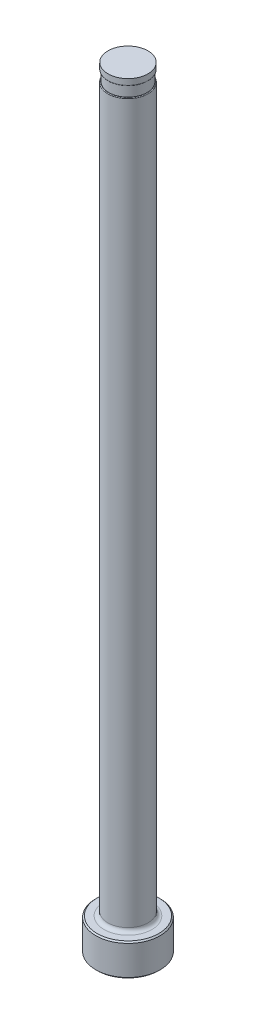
ISO-10303-21;
HEADER;
FILE_DESCRIPTION(('STEP AP214'),'2;1');
FILE_NAME('part.step','',(''),(''),'','','');
FILE_SCHEMA(('AUTOMOTIVE_DESIGN { 1 0 10303 214 1 1 1 1 }'));
ENDSEC;
DATA;
#1=APPLICATION_CONTEXT('core data for automotive mechanical design processes');
#2=APPLICATION_PROTOCOL_DEFINITION('international standard','automotive_design',2000,#1);
#3=PRODUCT_CONTEXT('',#1,'mechanical');
#4=PRODUCT('Part','Part','',(#3));
#5=PRODUCT_RELATED_PRODUCT_CATEGORY('part','',(#4));
#6=PRODUCT_DEFINITION_FORMATION('','',#4);
#7=PRODUCT_DEFINITION_CONTEXT('part definition',#1,'design');
#8=PRODUCT_DEFINITION('design','',#6,#7);
#9=PRODUCT_DEFINITION_SHAPE('','',#8);
#10=(LENGTH_UNIT() NAMED_UNIT(*) SI_UNIT(.MILLI.,.METRE.));
#11=(NAMED_UNIT(*) PLANE_ANGLE_UNIT() SI_UNIT($,.RADIAN.));
#12=(NAMED_UNIT(*) SI_UNIT($,.STERADIAN.) SOLID_ANGLE_UNIT());
#13=UNCERTAINTY_MEASURE_WITH_UNIT(LENGTH_MEASURE(1.E-05),#10,'distance_accuracy_value','');
#14=(GEOMETRIC_REPRESENTATION_CONTEXT(3) GLOBAL_UNCERTAINTY_ASSIGNED_CONTEXT((#13)) GLOBAL_UNIT_ASSIGNED_CONTEXT((#10,
#11,#12)) REPRESENTATION_CONTEXT('',''));
#15=CARTESIAN_POINT('',(0.,0.,0.));
#16=DIRECTION('',(0.,0.,1.));
#17=DIRECTION('',(1.,0.,0.));
#18=AXIS2_PLACEMENT_3D('',#15,#16,#17);
#19=CARTESIAN_POINT('',(-3.96874999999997,151.13,0.));
#20=DIRECTION('',(0.,1.,0.));
#21=DIRECTION('',(0.,0.,1.));
#22=AXIS2_PLACEMENT_3D('',#19,#20,#21);
#23=PLANE('',#22);
#24=CARTESIAN_POINT('',(0.,151.13,0.));
#25=DIRECTION('',(0.,1.,0.));
#26=DIRECTION('',(0.,0.,1.));
#27=AXIS2_PLACEMENT_3D('',#24,#25,#26);
#28=CIRCLE('',#27,3.82269999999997);
#29=CARTESIAN_POINT('',(0.,151.13,3.82269999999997));
#30=VERTEX_POINT('',#29);
#31=EDGE_CURVE('E11',#30,#30,#28,.F.);
#32=ORIENTED_EDGE('',*,*,#31,.T.);
#33=EDGE_LOOP('',(#32));
#34=FACE_BOUND('',#33,.T.);
#35=CARTESIAN_POINT('',(0.,151.13,0.));
#36=DIRECTION('',(0.,1.,0.));
#37=DIRECTION('',(0.,0.,1.));
#38=AXIS2_PLACEMENT_3D('',#35,#36,#37);
#39=CIRCLE('',#38,3.76554999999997);
#40=CARTESIAN_POINT('',(0.,151.13,3.76554999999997));
#41=VERTEX_POINT('',#40);
#42=EDGE_CURVE('E78',#41,#41,#39,.T.);
#43=ORIENTED_EDGE('',*,*,#42,.T.);
#44=EDGE_LOOP('',(#43));
#45=FACE_BOUND('',#44,.T.);
#46=ADVANCED_FACE('F36',(#34,#45),#23,.F.);
#47=CARTESIAN_POINT('',(0.,259.958771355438,0.));
#48=DIRECTION('',(0.,1.,0.));
#49=DIRECTION('',(0.,0.,1.));
#50=AXIS2_PLACEMENT_3D('',#47,#48,#49);
#51=CYLINDRICAL_SURFACE('',#50,3.96874999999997);
#52=DIRECTION('',(0.,1.,0.));
#53=VECTOR('',#52,1.);
#54=CARTESIAN_POINT('',(-3.76554999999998,259.958771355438,-1.25363860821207));
#55=LINE('',#54,#53);
#56=CARTESIAN_POINT('',(-3.76554999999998,148.971,-1.25363860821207));
#57=VERTEX_POINT('',#56);
#58=CARTESIAN_POINT('',(-3.76554999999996,86.614,-1.25363860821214));
#59=VERTEX_POINT('',#58);
#60=EDGE_CURVE('E73',#57,#59,#55,.F.);
#61=ORIENTED_EDGE('',*,*,#60,.F.);
#62=CARTESIAN_POINT('',(0.,148.971,0.));
#63=DIRECTION('',(0.,-1.,0.));
#64=DIRECTION('',(0.,0.,-1.));
#65=AXIS2_PLACEMENT_3D('',#62,#63,#64);
#66=CIRCLE('',#65,3.96874999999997);
#67=CARTESIAN_POINT('',(-3.76554999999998,148.971,1.25363860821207));
#68=VERTEX_POINT('',#67);
#69=EDGE_CURVE('E51',#57,#68,#66,.T.);
#70=ORIENTED_EDGE('',*,*,#69,.T.);
#71=DIRECTION('',(0.,1.,0.));
#72=VECTOR('',#71,1.);
#73=CARTESIAN_POINT('',(-3.76554999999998,259.958771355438,1.25363860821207));
#74=LINE('',#73,#72);
#75=CARTESIAN_POINT('',(-3.76554999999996,86.614,1.25363860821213));
#76=VERTEX_POINT('',#75);
#77=EDGE_CURVE('E84',#76,#68,#74,.T.);
#78=ORIENTED_EDGE('',*,*,#77,.F.);
#79=CARTESIAN_POINT('',(-3.76554999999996,86.614,-1.25363860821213));
#80=CARTESIAN_POINT('',(-3.76554761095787,86.5842664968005,-1.25363893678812));
#81=CARTESIAN_POINT('',(-3.76596820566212,86.5545487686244,-1.25238314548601));
#82=CARTESIAN_POINT('',(-3.76762981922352,86.4953538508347,-1.24737825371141));
#83=CARTESIAN_POINT('',(-3.76887065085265,86.4658766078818,-1.24362972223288));
#84=CARTESIAN_POINT('',(-3.77377172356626,86.3783445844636,-1.22871446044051));
#85=CARTESIAN_POINT('',(-3.7786109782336,86.3209361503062,-1.21387766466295));
#86=CARTESIAN_POINT('',(-3.79089599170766,86.2097164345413,-1.17494432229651));
#87=CARTESIAN_POINT('',(-3.79834108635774,86.1559042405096,-1.15085013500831));
#88=CARTESIAN_POINT('',(-3.81503450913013,86.0532087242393,-1.09423745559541));
#89=CARTESIAN_POINT('',(-3.82428345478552,86.0043270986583,-1.06171607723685));
#90=CARTESIAN_POINT('',(-3.84371902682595,85.912215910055,-0.989050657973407));
#91=CARTESIAN_POINT('',(-3.85391232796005,85.8690327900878,-0.94884982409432));
#92=CARTESIAN_POINT('',(-3.87421414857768,85.789439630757,-0.862218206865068));
#93=CARTESIAN_POINT('',(-3.88432263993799,85.7530317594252,-0.815785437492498));
#94=CARTESIAN_POINT('',(-3.90447970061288,85.6843203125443,-0.713424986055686));
#95=CARTESIAN_POINT('',(-3.91443636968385,85.6527071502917,-0.657016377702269));
#96=CARTESIAN_POINT('',(-3.93230837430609,85.5981594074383,-0.539855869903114));
#97=CARTESIAN_POINT('',(-3.94022284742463,85.5752284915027,-0.479102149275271));
#98=CARTESIAN_POINT('',(-3.95405226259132,85.5360681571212,-0.348163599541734));
#99=CARTESIAN_POINT('',(-3.95966879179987,85.520798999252,-0.277659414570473));
#100=CARTESIAN_POINT('',(-3.96709876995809,85.5007501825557,-0.134969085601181));
#101=CARTESIAN_POINT('',(-3.96891039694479,85.4959755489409,-0.0627821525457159));
#102=CARTESIAN_POINT('',(-3.96855474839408,85.4969169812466,0.0868803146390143));
#103=CARTESIAN_POINT('',(-3.96608295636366,85.5034359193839,0.16435170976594));
#104=CARTESIAN_POINT('',(-3.95680487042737,85.5286115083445,0.317057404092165));
#105=CARTESIAN_POINT('',(-3.94999780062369,85.5472703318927,0.392291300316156));
#106=CARTESIAN_POINT('',(-3.93277618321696,85.5968426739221,0.538182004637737));
#107=CARTESIAN_POINT('',(-3.92236273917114,85.6277524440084,0.608840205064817));
#108=CARTESIAN_POINT('',(-3.8991687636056,85.7017930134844,0.743029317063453));
#109=CARTESIAN_POINT('',(-3.88638957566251,85.7449168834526,0.806564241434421));
#110=CARTESIAN_POINT('',(-3.86127801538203,85.838843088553,0.919000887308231));
#111=CARTESIAN_POINT('',(-3.84899411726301,85.8887331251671,0.968673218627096));
#112=CARTESIAN_POINT('',(-3.82552074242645,85.9973276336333,1.05758636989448));
#113=CARTESIAN_POINT('',(-3.81433058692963,86.0560265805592,1.09683368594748));
#114=CARTESIAN_POINT('',(-3.79578266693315,86.1733369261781,1.15929047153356));
#115=CARTESIAN_POINT('',(-3.78813455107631,86.2312068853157,1.18381204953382));
#116=CARTESIAN_POINT('',(-3.77592606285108,86.350640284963,1.2221998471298));
#117=CARTESIAN_POINT('',(-3.77135975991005,86.4121963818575,1.23608653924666));
#118=CARTESIAN_POINT('',(-3.76759831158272,86.4976117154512,1.24747178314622));
#119=CARTESIAN_POINT('',(-3.76683119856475,86.520841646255,1.24978469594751));
#120=CARTESIAN_POINT('',(-3.76580747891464,86.5673769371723,1.25286606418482));
#121=CARTESIAN_POINT('',(-3.76555004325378,86.5906821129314,1.25363702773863));
#122=CARTESIAN_POINT('',(-3.76554999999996,86.614,1.25363860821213));
#123=B_SPLINE_CURVE_WITH_KNOTS('',3,(#79,#80,#81,#82,#83,#84,#85,#86,#87,#88,#89,#90,#91,#92,
#93,#94,#95,#96,#97,#98,#99,#100,#101,#102,#103,#104,#105,#106,#107,#108,#109,#110,#111,#112,
#113,#114,#115,#116,#117,#118,#119,#120,#121,#122),.UNSPECIFIED.,.F.,.F.,(4,2,2,2,2,2,2,2,2,2,2,
2,2,2,2,2,2,2,2,2,2,4),(0.,0.0891400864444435,0.178259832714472,0.355749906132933,
0.533194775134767,0.710700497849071,0.88957367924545,1.06850400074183,1.26397301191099,
1.45952443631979,1.67567306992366,1.89192518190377,2.12418795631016,2.35649231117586,
2.58872564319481,2.82082748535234,3.03401201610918,3.24706339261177,3.43601078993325,
3.62459353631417,3.6946217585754,3.76453598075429),.UNSPECIFIED.);
#124=EDGE_CURVE('E81',#59,#76,#123,.T.);
#125=ORIENTED_EDGE('',*,*,#124,.F.);
#126=EDGE_LOOP('',(#61,#70,#78,#125));
#127=FACE_BOUND('',#126,.T.);
#128=CARTESIAN_POINT('',(0.,7.11200000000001,0.));
#129=DIRECTION('',(0.,1.,0.));
#130=DIRECTION('',(0.,0.,1.));
#131=AXIS2_PLACEMENT_3D('',#128,#129,#130);
#132=CIRCLE('',#131,3.96874999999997);
#133=CARTESIAN_POINT('',(0.,7.11200000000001,3.96874999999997));
#134=VERTEX_POINT('',#133);
#135=EDGE_CURVE('E116',#134,#134,#132,.T.);
#136=ORIENTED_EDGE('',*,*,#135,.T.);
#137=EDGE_LOOP('',(#136));
#138=FACE_BOUND('',#137,.T.);
#139=ADVANCED_FACE('F82',(#127,#138),#51,.T.);
#140=CARTESIAN_POINT('',(0.,0.,0.));
#141=DIRECTION('',(0.,-1.,0.));
#142=DIRECTION('',(0.,0.,-1.));
#143=AXIS2_PLACEMENT_3D('',#140,#141,#142);
#144=PLANE('',#143);
#145=CARTESIAN_POINT('',(0.,0.,0.));
#146=DIRECTION('',(0.,-1.,0.));
#147=DIRECTION('',(0.,0.,-1.));
#148=AXIS2_PLACEMENT_3D('',#145,#146,#147);
#149=CIRCLE('',#148,6.09599999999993);
#150=CARTESIAN_POINT('',(0.,0.,-6.09599999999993));
#151=VERTEX_POINT('',#150);
#152=EDGE_CURVE('E113',#151,#151,#149,.T.);
#153=ORIENTED_EDGE('',*,*,#152,.T.);
#154=EDGE_LOOP('',(#153));
#155=FACE_BOUND('',#154,.T.);
#156=ADVANCED_FACE('F192',(#155),#144,.T.);
#157=CARTESIAN_POINT('',(0.,259.958771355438,0.));
#158=DIRECTION('',(0.,1.,0.));
#159=DIRECTION('',(0.,0.,1.));
#160=AXIS2_PLACEMENT_3D('',#157,#158,#159);
#161=CYLINDRICAL_SURFACE('',#160,6.34999999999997);
#162=CARTESIAN_POINT('',(0.,6.09599999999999,0.));
#163=DIRECTION('',(0.,1.,0.));
#164=DIRECTION('',(0.,0.,1.));
#165=AXIS2_PLACEMENT_3D('',#162,#163,#164);
#166=CIRCLE('',#165,6.34999999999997);
#167=CARTESIAN_POINT('',(0.,6.09599999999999,6.34999999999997));
#168=VERTEX_POINT('',#167);
#169=EDGE_CURVE('E110',#168,#168,#166,.F.);
#170=ORIENTED_EDGE('',*,*,#169,.T.);
#171=EDGE_LOOP('',(#170));
#172=FACE_BOUND('',#171,.T.);
#173=CARTESIAN_POINT('',(0.,0.254000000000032,0.));
#174=DIRECTION('',(0.,-1.,0.));
#175=DIRECTION('',(0.,0.,-1.));
#176=AXIS2_PLACEMENT_3D('',#173,#174,#175);
#177=CIRCLE('',#176,6.34999999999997);
#178=CARTESIAN_POINT('',(0.,0.254000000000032,-6.34999999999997));
#179=VERTEX_POINT('',#178);
#180=EDGE_CURVE('E107',#179,#179,#177,.F.);
#181=ORIENTED_EDGE('',*,*,#180,.T.);
#182=EDGE_LOOP('',(#181));
#183=FACE_BOUND('',#182,.T.);
#184=ADVANCED_FACE('F195',(#172,#183),#161,.T.);
#185=CARTESIAN_POINT('',(-6.34999999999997,6.35,0.));
#186=DIRECTION('',(0.,1.,0.));
#187=DIRECTION('',(0.,0.,1.));
#188=AXIS2_PLACEMENT_3D('',#185,#186,#187);
#189=PLANE('',#188);
#190=CARTESIAN_POINT('',(0.,6.35,0.));
#191=DIRECTION('',(0.,1.,0.));
#192=DIRECTION('',(0.,0.,1.));
#193=AXIS2_PLACEMENT_3D('',#190,#191,#192);
#194=CIRCLE('',#193,4.73074999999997);
#195=CARTESIAN_POINT('',(0.,6.35,4.73074999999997));
#196=VERTEX_POINT('',#195);
#197=EDGE_CURVE('E87',#196,#196,#194,.F.);
#198=ORIENTED_EDGE('',*,*,#197,.T.);
#199=EDGE_LOOP('',(#198));
#200=FACE_BOUND('',#199,.T.);
#201=CARTESIAN_POINT('',(0.,6.35,0.));
#202=DIRECTION('',(0.,1.,0.));
#203=DIRECTION('',(0.,0.,1.));
#204=AXIS2_PLACEMENT_3D('',#201,#202,#203);
#205=CIRCLE('',#204,6.096);
#206=CARTESIAN_POINT('',(0.,6.35,6.096));
#207=VERTEX_POINT('',#206);
#208=EDGE_CURVE('E104',#207,#207,#205,.T.);
#209=ORIENTED_EDGE('',*,*,#208,.T.);
#210=EDGE_LOOP('',(#209));
#211=FACE_BOUND('',#210,.T.);
#212=ADVANCED_FACE('F190',(#200,#211),#189,.T.);
#213=CARTESIAN_POINT('',(0.,6.35000000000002,0.));
#214=DIRECTION('',(0.,-1.,0.));
#215=DIRECTION('',(0.,0.,-1.));
#216=AXIS2_PLACEMENT_3D('',#213,#214,#215);
#217=CONICAL_SURFACE('',#216,6.09599999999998,0.78539816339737);
#218=ORIENTED_EDGE('',*,*,#169,.F.);
#219=EDGE_LOOP('',(#218));
#220=FACE_BOUND('',#219,.T.);
#221=ORIENTED_EDGE('',*,*,#208,.F.);
#222=EDGE_LOOP('',(#221));
#223=FACE_BOUND('',#222,.T.);
#224=ADVANCED_FACE('F186',(#220,#223),#217,.T.);
#225=CARTESIAN_POINT('',(0.,0.254000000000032,0.));
#226=DIRECTION('',(0.,1.,0.));
#227=DIRECTION('',(0.,0.,1.));
#228=AXIS2_PLACEMENT_3D('',#225,#226,#227);
#229=CONICAL_SURFACE('',#228,6.34999999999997,0.785398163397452);
#230=ORIENTED_EDGE('',*,*,#152,.F.);
#231=EDGE_LOOP('',(#230));
#232=FACE_BOUND('',#231,.T.);
#233=ORIENTED_EDGE('',*,*,#180,.F.);
#234=EDGE_LOOP('',(#233));
#235=FACE_BOUND('',#234,.T.);
#236=ADVANCED_FACE('F182',(#232,#235),#229,.T.);
#237=CARTESIAN_POINT('',(0.,7.11200000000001,0.));
#238=DIRECTION('',(0.,1.,0.));
#239=DIRECTION('',(0.,0.,1.));
#240=AXIS2_PLACEMENT_3D('',#237,#238,#239);
#241=TOROIDAL_SURFACE('',#240,4.73074999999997,0.762);
#242=ORIENTED_EDGE('',*,*,#197,.F.);
#243=EDGE_LOOP('',(#242));
#244=FACE_BOUND('',#243,.T.);
#245=ORIENTED_EDGE('',*,*,#135,.F.);
#246=EDGE_LOOP('',(#245));
#247=FACE_BOUND('',#246,.T.);
#248=ADVANCED_FACE('F147',(#244,#247),#241,.F.);
#249=CARTESIAN_POINT('',(-3.96874999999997,149.098,0.));
#250=DIRECTION('',(0.,-1.,0.));
#251=DIRECTION('',(0.,0.,-1.));
#252=AXIS2_PLACEMENT_3D('',#249,#250,#251);
#253=PLANE('',#252);
#254=DIRECTION('',(0.,0.,1.));
#255=VECTOR('',#254,1.);
#256=CARTESIAN_POINT('',(-3.76554999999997,149.098,0.));
#257=LINE('',#256,#255);
#258=CARTESIAN_POINT('',(-3.76554999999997,149.098,0.));
#259=VERTEX_POINT('',#258);
#260=CARTESIAN_POINT('',(-3.76554999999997,149.098,0.761364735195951));
#261=VERTEX_POINT('',#260);
#262=EDGE_CURVE('E90',#259,#261,#257,.T.);
#263=ORIENTED_EDGE('',*,*,#262,.T.);
#264=CARTESIAN_POINT('',(0.,149.098,0.));
#265=DIRECTION('',(0.,-1.,0.));
#266=DIRECTION('',(0.,0.,-1.));
#267=AXIS2_PLACEMENT_3D('',#264,#265,#266);
#268=CIRCLE('',#267,3.84174999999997);
#269=CARTESIAN_POINT('',(-3.76554999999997,149.098,-0.761364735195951));
#270=VERTEX_POINT('',#269);
#271=EDGE_CURVE('E86',#261,#270,#268,.F.);
#272=ORIENTED_EDGE('',*,*,#271,.T.);
#273=EDGE_CURVE('E79',#270,#259,#257,.T.);
#274=ORIENTED_EDGE('',*,*,#273,.T.);
#275=CARTESIAN_POINT('',(0.,149.098,0.));
#276=DIRECTION('',(0.,1.,0.));
#277=DIRECTION('',(0.,0.,1.));
#278=AXIS2_PLACEMENT_3D('',#275,#276,#277);
#279=CIRCLE('',#278,3.76554999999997);
#280=EDGE_CURVE('E101',#259,#259,#279,.T.);
#281=ORIENTED_EDGE('',*,*,#280,.F.);
#282=EDGE_LOOP('',(#263,#272,#274,#281));
#283=FACE_BOUND('',#282,.T.);
#284=ADVANCED_FACE('F144',(#283),#253,.F.);
#285=CARTESIAN_POINT('',(0.,153.448281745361,0.));
#286=DIRECTION('',(0.,1.,0.));
#287=DIRECTION('',(0.,0.,1.));
#288=AXIS2_PLACEMENT_3D('',#285,#286,#287);
#289=CYLINDRICAL_SURFACE('',#288,3.76554999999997);
#290=ORIENTED_EDGE('',*,*,#42,.F.);
#291=EDGE_LOOP('',(#290));
#292=FACE_BOUND('',#291,.T.);
#293=ORIENTED_EDGE('',*,*,#280,.T.);
#294=EDGE_LOOP('',(#293));
#295=FACE_BOUND('',#294,.T.);
#296=ADVANCED_FACE('F141',(#292,#295),#289,.T.);
#297=CARTESIAN_POINT('',(-3.76554999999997,150.114,-6.34999999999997));
#298=DIRECTION('',(1.,0.,0.));
#299=DIRECTION('',(0.,1.,0.));
#300=AXIS2_PLACEMENT_3D('',#297,#298,#299);
#301=PLANE('',#300);
#302=ORIENTED_EDGE('',*,*,#273,.F.);
#303=CARTESIAN_POINT('',(-3.76554999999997,149.098,-0.761364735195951));
#304=CARTESIAN_POINT('',(-3.76554999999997,149.097994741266,-0.782493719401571));
#305=CARTESIAN_POINT('',(-3.76554999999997,149.097792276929,-0.803626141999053));
#306=CARTESIAN_POINT('',(-3.76554999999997,149.096859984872,-0.845902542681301));
#307=CARTESIAN_POINT('',(-3.76554999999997,149.096129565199,-0.867046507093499));
#308=CARTESIAN_POINT('',(-3.76554999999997,149.094000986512,-0.909439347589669));
#309=CARTESIAN_POINT('',(-3.76554999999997,149.092598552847,-0.930688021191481));
#310=CARTESIAN_POINT('',(-3.76554999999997,149.088932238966,-0.97310444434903));
#311=CARTESIAN_POINT('',(-3.76554999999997,149.086668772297,-0.994272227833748));
#312=CARTESIAN_POINT('',(-3.76554999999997,149.081963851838,-1.02925031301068));
#313=CARTESIAN_POINT('',(-3.76554999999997,149.079847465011,-1.04310326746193));
#314=CARTESIAN_POINT('',(-3.76554999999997,149.074992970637,-1.07067599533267));
#315=CARTESIAN_POINT('',(-3.76554999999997,149.072255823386,-1.08439594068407));
#316=CARTESIAN_POINT('',(-3.76554999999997,149.064714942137,-1.117227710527));
#317=CARTESIAN_POINT('',(-3.76554999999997,149.059523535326,-1.13626053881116));
#318=CARTESIAN_POINT('',(-3.76554999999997,149.049554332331,-1.1650285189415));
#319=CARTESIAN_POINT('',(-3.76554999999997,149.045656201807,-1.17506664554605));
#320=CARTESIAN_POINT('',(-3.76554999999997,149.036804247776,-1.19465815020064));
#321=CARTESIAN_POINT('',(-3.76554999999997,149.031854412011,-1.2042131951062));
#322=CARTESIAN_POINT('',(-3.76554999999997,149.023843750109,-1.21677899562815));
#323=CARTESIAN_POINT('',(-3.76554999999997,149.021472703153,-1.22022603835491));
#324=CARTESIAN_POINT('',(-3.76554999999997,149.016417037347,-1.22689753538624));
#325=CARTESIAN_POINT('',(-3.76554999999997,149.013731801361,-1.23012153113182));
#326=CARTESIAN_POINT('',(-3.76554999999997,149.007951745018,-1.23626135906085));
#327=CARTESIAN_POINT('',(-3.76554999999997,149.004852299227,-1.23917292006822));
#328=CARTESIAN_POINT('',(-3.76554999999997,148.998201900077,-1.24442799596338));
#329=CARTESIAN_POINT('',(-3.76554999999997,148.994652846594,-1.24677378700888));
#330=CARTESIAN_POINT('',(-3.76554999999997,148.988648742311,-1.2497967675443));
#331=CARTESIAN_POINT('',(-3.76554999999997,148.986340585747,-1.25076391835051));
#332=CARTESIAN_POINT('',(-3.76554999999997,148.981598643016,-1.25230606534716));
#333=CARTESIAN_POINT('',(-3.76554999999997,148.979165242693,-1.2528821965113));
#334=CARTESIAN_POINT('',(-3.76554999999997,148.975758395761,-1.25336754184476));
#335=CARTESIAN_POINT('',(-3.76554999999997,148.974810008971,-1.2534689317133));
#336=CARTESIAN_POINT('',(-3.76554999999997,148.972907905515,-1.25360450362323));
#337=CARTESIAN_POINT('',(-3.76554999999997,148.971954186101,-1.25363864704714));
#338=CARTESIAN_POINT('',(-3.76554999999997,148.971,-1.25363860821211));
#339=B_SPLINE_CURVE_WITH_KNOTS('',3,(#303,#304,#305,#306,#307,#308,#309,#310,#311,#312,#313,
#314,#315,#316,#317,#318,#319,#320,#321,#322,#323,#324,#325,#326,#327,#328,#329,#330,#331,#332,
#333,#334,#335,#336,#337,#338),.UNSPECIFIED.,.F.,.F.,(4,2,2,2,2,2,2,2,2,2,2,2,2,2,2,2,2,4),(0.,
0.0633913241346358,0.126853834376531,0.19072549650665,0.254566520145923,0.29659421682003,
0.338557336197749,0.397605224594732,0.429880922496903,0.462036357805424,0.474575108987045,
0.487138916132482,0.499857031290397,0.512523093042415,0.520004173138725,0.527463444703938,
0.530322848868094,0.533183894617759),.UNSPECIFIED.);
#340=EDGE_CURVE('E59',#270,#57,#339,.T.);
#341=ORIENTED_EDGE('',*,*,#340,.T.);
#342=ORIENTED_EDGE('',*,*,#60,.T.);
#343=DIRECTION('',(0.,0.,1.));
#344=VECTOR('',#343,1.);
#345=CARTESIAN_POINT('',(-3.76554999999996,86.614,-6.34999999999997));
#346=LINE('',#345,#344);
#347=EDGE_CURVE('E77',#59,#76,#346,.T.);
#348=ORIENTED_EDGE('',*,*,#347,.T.);
#349=ORIENTED_EDGE('',*,*,#77,.T.);
#350=CARTESIAN_POINT('',(-3.76554999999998,148.971,1.25363860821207));
#351=CARTESIAN_POINT('',(-3.76554999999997,148.973613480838,1.25364684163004));
#352=CARTESIAN_POINT('',(-3.76554999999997,148.976215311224,1.25338363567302));
#353=CARTESIAN_POINT('',(-3.76554999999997,148.981293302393,1.25239294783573));
#354=CARTESIAN_POINT('',(-3.76554999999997,148.983770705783,1.25167195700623));
#355=CARTESIAN_POINT('',(-3.76554999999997,148.989154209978,1.24961912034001));
#356=CARTESIAN_POINT('',(-3.76554999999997,148.992019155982,1.24818173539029));
#357=CARTESIAN_POINT('',(-3.76554999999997,148.997493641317,1.24486563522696));
#358=CARTESIAN_POINT('',(-3.76554999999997,149.00010160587,1.24298441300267));
#359=CARTESIAN_POINT('',(-3.76554999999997,149.006800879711,1.23749178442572));
#360=CARTESIAN_POINT('',(-3.76554999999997,149.010652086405,1.23359127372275));
#361=CARTESIAN_POINT('',(-3.76554999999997,149.017763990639,1.22529610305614));
#362=CARTESIAN_POINT('',(-3.76554999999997,149.021023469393,1.22090045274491));
#363=CARTESIAN_POINT('',(-3.76554999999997,149.032610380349,1.203601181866));
#364=CARTESIAN_POINT('',(-3.76554999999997,149.039424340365,1.18970762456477));
#365=CARTESIAN_POINT('',(-3.76554999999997,149.051184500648,1.16115732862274));
#366=CARTESIAN_POINT('',(-3.76554999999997,149.056117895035,1.1464961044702));
#367=CARTESIAN_POINT('',(-3.76554999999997,149.067974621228,1.10570448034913));
#368=CARTESIAN_POINT('',(-3.76554999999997,149.073623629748,1.07920308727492));
#369=CARTESIAN_POINT('',(-3.76554999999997,149.08273714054,1.02581528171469));
#370=CARTESIAN_POINT('',(-3.76554999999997,149.086195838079,0.998928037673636));
#371=CARTESIAN_POINT('',(-3.76554999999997,149.091595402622,0.944998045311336));
#372=CARTESIAN_POINT('',(-3.76554999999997,149.093536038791,0.9179552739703));
#373=CARTESIAN_POINT('',(-3.76554999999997,149.096323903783,0.863847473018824));
#374=CARTESIAN_POINT('',(-3.76554999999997,149.097172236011,0.836782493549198));
#375=CARTESIAN_POINT('',(-3.76554999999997,149.097747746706,0.801647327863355));
#376=CARTESIAN_POINT('',(-3.76554999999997,149.09784390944,0.793581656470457));
#377=CARTESIAN_POINT('',(-3.76554999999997,149.097969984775,0.777465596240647));
#378=CARTESIAN_POINT('',(-3.76554999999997,149.098000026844,0.769415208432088));
#379=CARTESIAN_POINT('',(-3.76554999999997,149.098,0.761364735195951));
#380=B_SPLINE_CURVE_WITH_KNOTS('',3,(#350,#351,#352,#353,#354,#355,#356,#357,#358,#359,#360,
#361,#362,#363,#364,#365,#366,#367,#368,#369,#370,#371,#372,#373,#374,#375,#376,#377,#378,#379),
.UNSPECIFIED.,.F.,.F.,(4,2,2,2,2,2,2,2,2,2,2,2,2,2,4),(0.,0.00780850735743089,0.01550869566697,
0.0250704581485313,0.0346875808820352,0.0510390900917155,0.0674239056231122,0.113484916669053,
0.159854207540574,0.240929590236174,0.322218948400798,0.403520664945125,0.484740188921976,
0.508938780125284,0.533089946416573),.UNSPECIFIED.);
#381=EDGE_CURVE('E172',#68,#261,#380,.T.);
#382=ORIENTED_EDGE('',*,*,#381,.T.);
#383=ORIENTED_EDGE('',*,*,#262,.F.);
#384=EDGE_LOOP('',(#302,#341,#342,#348,#349,#382,#383));
#385=FACE_BOUND('',#384,.T.);
#386=ADVANCED_FACE('F75',(#385),#301,.F.);
#387=CARTESIAN_POINT('',(-6.94054999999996,86.614,-6.34999999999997));
#388=DIRECTION('',(0.,0.,1.));
#389=DIRECTION('',(1.,0.,0.));
#390=AXIS2_PLACEMENT_3D('',#387,#388,#389);
#391=CYLINDRICAL_SURFACE('',#390,3.175);
#392=ORIENTED_EDGE('',*,*,#347,.F.);
#393=ORIENTED_EDGE('',*,*,#124,.T.);
#394=EDGE_LOOP('',(#392,#393));
#395=FACE_BOUND('',#394,.T.);
#396=ADVANCED_FACE('F89',(#395),#391,.F.);
#397=CARTESIAN_POINT('',(0.,152.687735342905,0.));
#398=DIRECTION('',(0.,1.,0.));
#399=DIRECTION('',(0.,0.,1.));
#400=AXIS2_PLACEMENT_3D('',#397,#398,#399);
#401=CYLINDRICAL_SURFACE('',#400,3.94969999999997);
#402=CARTESIAN_POINT('',(0.,151.257,0.));
#403=DIRECTION('',(0.,1.,0.));
#404=DIRECTION('',(0.,0.,1.));
#405=AXIS2_PLACEMENT_3D('',#402,#403,#404);
#406=CIRCLE('',#405,3.94969999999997);
#407=CARTESIAN_POINT('',(0.,151.257,3.94969999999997));
#408=VERTEX_POINT('',#407);
#409=EDGE_CURVE('E44',#408,#408,#406,.T.);
#410=ORIENTED_EDGE('',*,*,#409,.T.);
#411=EDGE_LOOP('',(#410));
#412=FACE_BOUND('',#411,.T.);
#413=CARTESIAN_POINT('',(0.,152.4,0.));
#414=DIRECTION('',(0.,1.,0.));
#415=DIRECTION('',(0.,0.,1.));
#416=AXIS2_PLACEMENT_3D('',#413,#414,#415);
#417=CIRCLE('',#416,3.94969999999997);
#418=CARTESIAN_POINT('',(0.,152.4,3.94969999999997));
#419=VERTEX_POINT('',#418);
#420=EDGE_CURVE('E91',#419,#419,#417,.T.);
#421=ORIENTED_EDGE('',*,*,#420,.F.);
#422=EDGE_LOOP('',(#421));
#423=FACE_BOUND('',#422,.T.);
#424=ADVANCED_FACE('F135',(#412,#423),#401,.T.);
#425=CARTESIAN_POINT('',(-3.96874999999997,152.4,0.));
#426=DIRECTION('',(0.,1.,0.));
#427=DIRECTION('',(0.,0.,1.));
#428=AXIS2_PLACEMENT_3D('',#425,#426,#427);
#429=PLANE('',#428);
#430=ORIENTED_EDGE('',*,*,#420,.T.);
#431=EDGE_LOOP('',(#430));
#432=FACE_BOUND('',#431,.T.);
#433=ADVANCED_FACE('F149',(#432),#429,.T.);
#434=CARTESIAN_POINT('',(0.,148.971,0.));
#435=DIRECTION('',(0.,-1.,0.));
#436=DIRECTION('',(0.,0.,-1.));
#437=AXIS2_PLACEMENT_3D('',#434,#435,#436);
#438=TOROIDAL_SURFACE('',#437,3.84174999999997,0.127);
#439=ORIENTED_EDGE('',*,*,#381,.F.);
#440=ORIENTED_EDGE('',*,*,#69,.F.);
#441=ORIENTED_EDGE('',*,*,#340,.F.);
#442=ORIENTED_EDGE('',*,*,#271,.F.);
#443=EDGE_LOOP('',(#439,#440,#441,#442));
#444=FACE_BOUND('',#443,.T.);
#445=ADVANCED_FACE('F151',(#444),#438,.T.);
#446=CARTESIAN_POINT('',(0.,151.257,0.));
#447=DIRECTION('',(0.,1.,0.));
#448=DIRECTION('',(0.,0.,1.));
#449=AXIS2_PLACEMENT_3D('',#446,#447,#448);
#450=TOROIDAL_SURFACE('',#449,3.82269999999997,0.127);
#451=ORIENTED_EDGE('',*,*,#31,.F.);
#452=EDGE_LOOP('',(#451));
#453=FACE_BOUND('',#452,.T.);
#454=ORIENTED_EDGE('',*,*,#409,.F.);
#455=EDGE_LOOP('',(#454));
#456=FACE_BOUND('',#455,.T.);
#457=ADVANCED_FACE('F38',(#453,#456),#450,.T.);
#458=CLOSED_SHELL('',(#46,#139,#156,#184,#212,#224,#236,#248,#284,#296,#386,#396,#424,#433,#445,#457));
#459=MANIFOLD_SOLID_BREP('B2',#458);
#460=ADVANCED_BREP_SHAPE_REPRESENTATION('',(#18,#459),#14);
#461=SHAPE_DEFINITION_REPRESENTATION(#9,#460);
ENDSEC;
END-ISO-10303-21;
